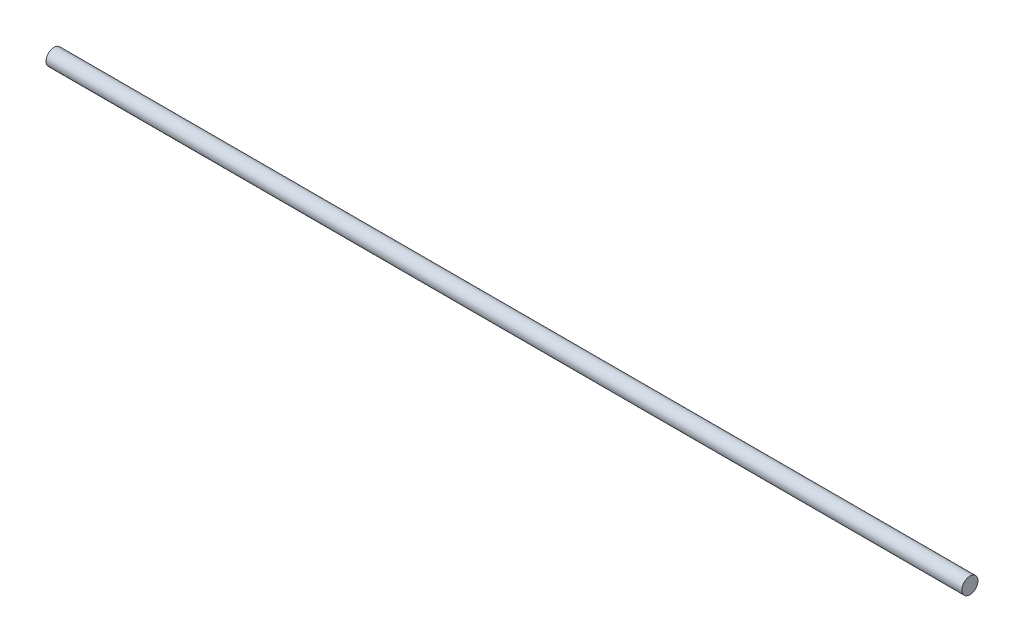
from build123d import *

# Parameters (mm, degrees)
SKETCH1_R      = 7.6
EXTRUDE1_DEPTH = 431.8


with BuildPart() as part:
    # Sketch1 → Extrude1 (new, symmetric)
    with BuildSketch(Plane(origin=(0, 0, 0), x_dir=(0, 0, -1), z_dir=(1, 0, 0))):
        Circle(SKETCH1_R)
    extrude(amount=EXTRUDE1_DEPTH, both=True)


solid = part.part
